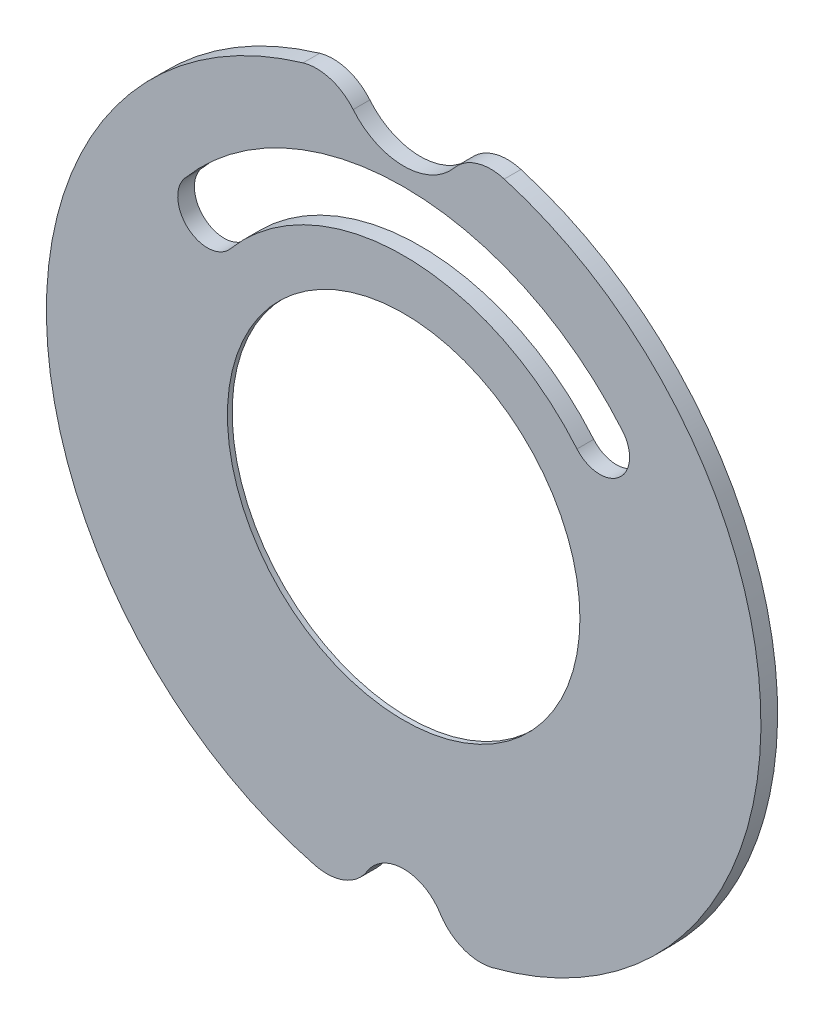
from build123d import *

# Parameters (mm, degrees)
ESQUISSE1_R             = 150
EXTRUSION1_DEPTH        = 7
ESQUISSE2_R             = 27.5
ENL_V_MAT_EXTRU_1_DEPTH = 339.732431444
CONG_1_R                = 20
ESQUISSE3_R             = 18
ENL_V_MAT_EXTRU_2_DEPTH = 385.77160161
CONG_2_R                = 20
COQUE1_T                = -2
ESQUISSE4_R             = 74
ENL_V_MAT_EXTRU_3_DEPTH = 210.391988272


with BuildPart() as part:
    # Esquisse1 → Extrusion1 (new body)
    with BuildSketch(Plane.XY):
        Circle(ESQUISSE1_R)
        with BuildLine():
            ThreePointArc((72.774222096, 61.06482292), (0, 95), (-72.774222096, 61.06482292))
            ThreePointArc((-72.774222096, 61.06482292), (-90.384622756, 59.524112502), (-91.925333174, 77.134513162))
            ThreePointArc((-91.925333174, 77.134513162), (0, 120), (91.925333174, 77.134513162))
            ThreePointArc((91.925333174, 77.134513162), (90.384622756, 59.524112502), (72.774222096, 61.06482292))
        make_face(mode=Mode.SUBTRACT)
    extrude(amount=EXTRUSION1_DEPTH)

    # Esquisse2 → Enl_v. mat.-Extru.1 (cut, through all)
    with BuildSketch(Plane(origin=(-3.304130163, -151.974342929, 7), x_dir=(1, 0, 0), z_dir=(0, 0, 1))):
        with Locations((3.304130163, 306.974342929)):
            Circle(ESQUISSE2_R)
    extrude(amount=-ENL_V_MAT_EXTRU_1_DEPTH, mode=Mode.SUBTRACT)

    # Cong_1
    cong_1_edges = [part.edges().sort_by_distance(p)[0] for p in [
        (-26.497113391, 147.641129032, 3.5),
        (26.497113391, 147.641129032, 3.5),
    ]]
    fillet(cong_1_edges, radius=CONG_1_R)

    # Esquisse3 → Enl_v. mat.-Extru.2 (cut, through all)
    with BuildSketch(Plane(origin=(163.78369945, 72.575774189, 7), x_dir=(1, 0, 0), z_dir=(0, 0, 1))):
        with Locations((-163.78369945, -218.575774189)):
            Circle(ESQUISSE3_R)
    extrude(amount=-ENL_V_MAT_EXTRU_2_DEPTH, mode=Mode.SUBTRACT)

    # Cong_2
    cong_2_edges = [part.edges().sort_by_distance(p)[0] for p in [
        (17.757414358, -148.945205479, 3.5),
        (-17.757414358, -148.945205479, 3.5),
    ]]
    fillet(cong_2_edges, radius=CONG_2_R)

    # Coque1
    coque1_openings = [part.faces().sort_by_distance(p)[0] for p in [
        (0, -7.88729342, 0),
    ]]
    offset(amount=COQUE1_T, openings=coque1_openings)

    # Esquisse4 → Enl_v. mat.-Extru.3 (cut, through all)
    with BuildSketch(Plane.XY.offset(7)):
        Circle(ESQUISSE4_R)
    extrude(amount=-ENL_V_MAT_EXTRU_3_DEPTH, mode=Mode.SUBTRACT)


solid = part.part
